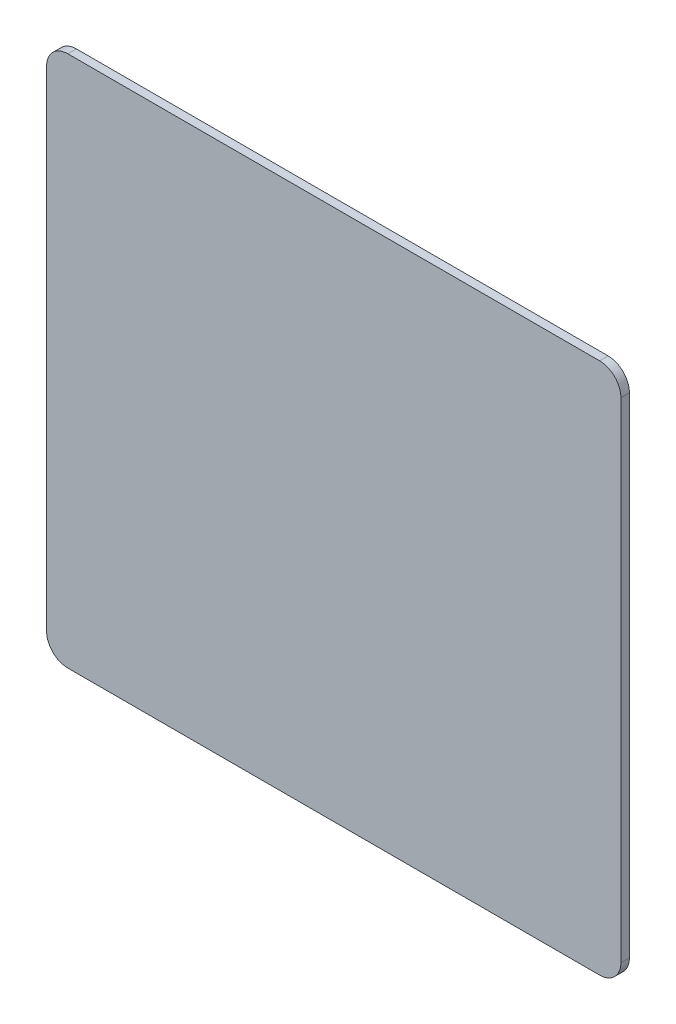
from build123d import *

# Parameters (mm, degrees)
SKETCH1_W           = 215.9
SKETCH1_H           = 200
BOSS_EXTRUDE1_DEPTH = 3.2
FILLET1_R           = 8


with BuildPart() as part:
    # Sketch1 → Boss-Extrude1 (new body)
    with BuildSketch(Plane.XY):
        Rectangle(SKETCH1_W, SKETCH1_H)
    extrude(amount=BOSS_EXTRUDE1_DEPTH)

    # Fillet1
    fillet1_edges = [part.edges().sort_by_distance(p)[0] for p in [
        (107.95, -100, 1.6),
        (-107.95, -100, 1.6),
        (-107.95, 100, 1.6),
        (107.95, 100, 1.6),
    ]]
    fillet(fillet1_edges, radius=FILLET1_R)


solid = part.part
